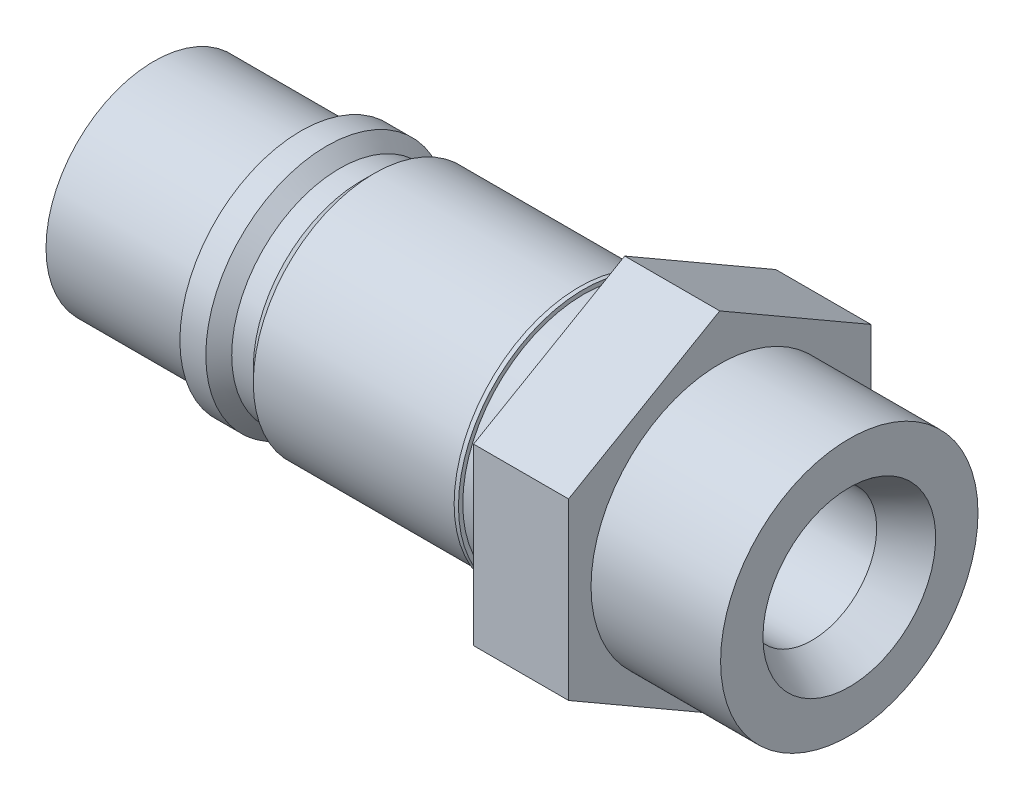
from build123d import *

# Parameters (mm, degrees)
SALIENTE_EXTRUIR2_DEPTH = 22
CROQUIS5_R              = 29.8
SALIENTE_EXTRUIR3_DEPTH = 30


with BuildPart() as part:
    # Croquis1 → Revoluci_n1 (revolve)
    with BuildSketch(Plane.XY, mode=Mode.PRIVATE) as revoluci_n1_sk:
        Polygon((0, 0), (0, 25), (34, 25), (34, 28), (40, 28), (43, 25), (48, 25), (51, 28), (98.5, 28), (98.5, 29), (99.5, 29), (99.5, 28), (109, 28), (109, 0), align=None)
    revolve(revoluci_n1_sk.sketch.rotate(Axis((0, 0, 0), (1, 0, 0)), 90), axis=Axis((0, 0, 0), (1, 0, 0)))

    # Croquis4 → Saliente-Extruir2 (add)
    with BuildSketch(Plane(origin=(109, 0, 0), x_dir=(0, 0, -1), z_dir=(1, 0, 0))):
        Polygon((0, 40.414518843), (-35, 20.207259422), (-35, -20.207259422), (0, -40.414518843), (35, -20.207259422), (35, 20.207259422), align=None)
    extrude(amount=SALIENTE_EXTRUIR2_DEPTH)

    # Croquis5 → Saliente-Extruir3 (add)
    with BuildSketch(Plane(origin=(131, 0, 0), x_dir=(0, 0, -1), z_dir=(1, 0, 0))):
        Circle(CROQUIS5_R)
    extrude(amount=SALIENTE_EXTRUIR3_DEPTH)

    # Croquis6 → Cortar-Revoluci_n1 (revolve, cut)
    with BuildSketch(Plane.XY, mode=Mode.PRIVATE) as cortar_revoluci_n1_sk:
        Polygon((0, 0), (0, 15), (152.339745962, 15), (161, 20), (161, 0), align=None)
    revolve(cortar_revoluci_n1_sk.sketch.rotate(Axis((0, 0, 0), (1, 0, 0)), 90), axis=Axis((0, 0, 0), (1, 0, 0)), mode=Mode.SUBTRACT)


solid = part.part
